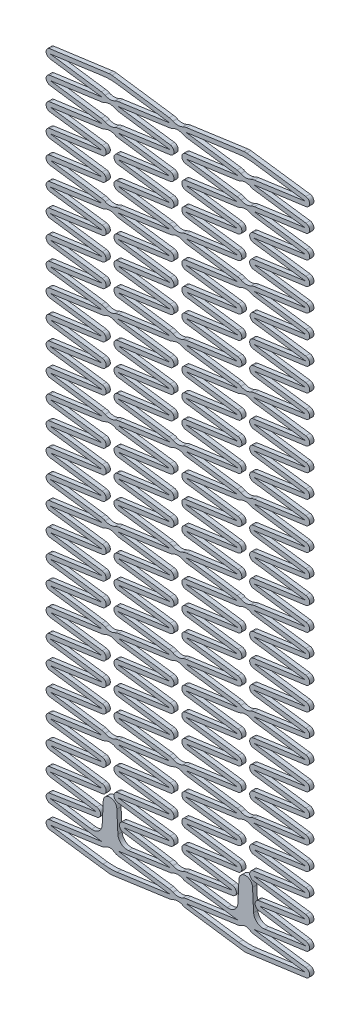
from build123d import *

# Parameters (mm, degrees)
LINEAR_AUSTRAGEN1_DEPTH = 0.2


with BuildPart() as part:
    # Skizze1 → Linear austragen1 (new body)
    with BuildSketch(Plane.XY):
        with BuildLine():
            Line((47.678280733, 2.107839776), (50.128723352, 1.769535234))
            ThreePointArc((50.128723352, 1.769535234), (50.310280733, 1.564104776), (50.128723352, 1.358674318))
            Line((50.128723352, 1.358674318), (47.678280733, 1.020369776))
            Line((47.678280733, 1.020369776), (50.128723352, 0.682065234))
            ThreePointArc((50.128723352, 0.682065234), (50.310280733, 0.476634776), (50.128723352, 0.271204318))
            Line((50.128723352, 0.271204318), (47.678280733, -0.067100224))
            Line((47.678280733, -0.067100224), (50.128723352, -0.405404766))
            ThreePointArc((50.128723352, -0.405404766), (50.310280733, -0.610835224), (50.128723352, -0.816265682))
            Line((50.128723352, -0.816265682), (47.678280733, -1.154570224))
            Line((47.678280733, -1.154570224), (50.128723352, -1.492874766))
            ThreePointArc((50.128723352, -1.492874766), (50.310280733, -1.698305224), (50.128723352, -1.903735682))
            Line((50.128723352, -1.903735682), (47.678280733, -2.242040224))
            Line((47.678280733, -2.242040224), (50.128723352, -2.580344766))
            ThreePointArc((50.128723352, -2.580344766), (50.310280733, -2.785775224), (50.128723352, -2.991205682))
            Line((50.128723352, -2.991205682), (47.678280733, -3.329510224))
            Line((47.678280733, -3.329510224), (50.128723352, -3.667814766))
            ThreePointArc((50.128723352, -3.667814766), (50.310280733, -3.873245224), (50.128723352, -4.078675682))
            Line((50.128723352, -4.078675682), (47.678280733, -4.416980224))
            Line((47.678280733, -4.416980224), (50.128723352, -4.755284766))
            ThreePointArc((50.128723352, -4.755284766), (50.310280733, -4.960715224), (50.128723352, -5.166145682))
            Line((50.128723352, -5.166145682), (47.936973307, -5.504450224))
            Line((47.936973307, -5.504450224), (50.128723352, -5.842754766))
            ThreePointArc((50.128723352, -5.842754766), (50.310280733, -6.048185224), (50.128723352, -6.253615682))
            Line((50.128723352, -6.253615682), (47.678280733, -6.591920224))
            Line((47.678280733, -6.591920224), (50.128723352, -6.930224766))
            ThreePointArc((50.128723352, -6.930224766), (50.310280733, -7.135655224), (50.128723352, -7.341085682))
            Line((50.128723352, -7.341085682), (47.337526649, -7.721250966))
            ThreePointArc((47.337526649, -7.721250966), (47.269031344, -7.725824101), (47.200555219, -7.720972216))
            Line((47.200555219, -7.720972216), (44.493838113, -7.341085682))
            ThreePointArc((44.493838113, -7.341085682), (44.403939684, -7.321957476), (44.319059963, -7.286700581))
            ThreePointArc((44.319059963, -7.286700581), (44.087280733, -7.231053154), (43.855501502, -7.286700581))
            ThreePointArc((43.855501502, -7.286700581), (43.770621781, -7.321957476), (43.680723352, -7.341085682))
            Line((43.680723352, -7.341085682), (40.974006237, -7.720972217))
            ThreePointArc((40.974006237, -7.720972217), (40.905530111, -7.725824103), (40.837034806, -7.721250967))
            Line((40.837034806, -7.721250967), (38.045838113, -7.341085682))
            ThreePointArc((38.045838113, -7.341085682), (37.864280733, -7.135655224), (38.045838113, -6.930224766))
            Line((38.045838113, -6.930224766), (40.496280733, -6.591920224))
            Line((40.496280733, -6.591920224), (38.045838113, -6.253615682))
            ThreePointArc((38.045838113, -6.253615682), (37.864280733, -6.048185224), (38.045838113, -5.842754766))
            Line((38.045838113, -5.842754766), (40.237588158, -5.504450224))
            Line((40.237588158, -5.504450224), (38.045838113, -5.166145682))
            ThreePointArc((38.045838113, -5.166145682), (37.864280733, -4.960715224), (38.045838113, -4.755284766))
            Line((38.045838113, -4.755284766), (40.496280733, -4.416980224))
            Line((40.496280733, -4.416980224), (38.045838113, -4.078675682))
            ThreePointArc((38.045838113, -4.078675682), (37.864280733, -3.873245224), (38.045838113, -3.667814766))
            Line((38.045838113, -3.667814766), (40.496280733, -3.329510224))
            Line((40.496280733, -3.329510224), (38.045838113, -2.991205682))
            ThreePointArc((38.045838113, -2.991205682), (37.864280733, -2.785775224), (38.045838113, -2.580344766))
            Line((38.045838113, -2.580344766), (40.496280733, -2.242040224))
            Line((40.496280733, -2.242040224), (38.045838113, -1.903735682))
            ThreePointArc((38.045838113, -1.903735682), (37.864280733, -1.698305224), (38.045838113, -1.492874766))
            Line((38.045838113, -1.492874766), (40.496280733, -1.154570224))
            Line((40.496280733, -1.154570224), (38.045838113, -0.816265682))
            ThreePointArc((38.045838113, -0.816265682), (37.864280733, -0.610835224), (38.045838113, -0.405404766))
            Line((38.045838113, -0.405404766), (40.496280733, -0.067100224))
            Line((40.496280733, -0.067100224), (38.045838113, 0.271204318))
            ThreePointArc((38.045838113, 0.271204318), (37.864280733, 0.476634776), (38.045838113, 0.682065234))
            Line((38.045838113, 0.682065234), (40.496280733, 1.020369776))
            Line((40.496280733, 1.020369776), (38.045838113, 1.358674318))
            ThreePointArc((38.045838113, 1.358674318), (37.864280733, 1.564104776), (38.045838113, 1.769535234))
            Line((38.045838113, 1.769535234), (40.496280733, 2.107839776))
            Line((40.496280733, 2.107839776), (38.045838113, 2.446144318))
            ThreePointArc((38.045838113, 2.446144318), (37.864280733, 2.651574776), (38.045838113, 2.857005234))
            Line((38.045838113, 2.857005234), (40.496280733, 3.195309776))
            Line((40.496280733, 3.195309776), (38.045838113, 3.533614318))
            ThreePointArc((38.045838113, 3.533614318), (37.864280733, 3.739044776), (38.045838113, 3.944475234))
            Line((38.045838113, 3.944475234), (40.496280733, 4.282779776))
            Line((40.496280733, 4.282779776), (38.045838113, 4.621084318))
            ThreePointArc((38.045838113, 4.621084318), (37.864280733, 4.826514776), (38.045838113, 5.031945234))
            Line((38.045838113, 5.031945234), (40.496280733, 5.370249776))
            Line((40.496280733, 5.370249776), (38.045838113, 5.708554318))
            ThreePointArc((38.045838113, 5.708554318), (37.864280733, 5.913984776), (38.045838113, 6.119415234))
            Line((38.045838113, 6.119415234), (40.496280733, 6.457719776))
            Line((40.496280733, 6.457719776), (38.045838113, 6.796024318))
            ThreePointArc((38.045838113, 6.796024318), (37.864280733, 7.001454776), (38.045838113, 7.206885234))
            Line((38.045838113, 7.206885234), (40.496280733, 7.545189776))
            Line((40.496280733, 7.545189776), (38.045838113, 7.883494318))
            ThreePointArc((38.045838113, 7.883494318), (37.864280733, 8.088924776), (38.045838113, 8.294355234))
            Line((38.045838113, 8.294355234), (40.496280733, 8.632659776))
            Line((40.496280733, 8.632659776), (38.045838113, 8.970964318))
            ThreePointArc((38.045838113, 8.970964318), (37.864280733, 9.176394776), (38.045838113, 9.381825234))
            Line((38.045838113, 9.381825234), (40.496280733, 9.720129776))
            Line((40.496280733, 9.720129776), (38.045838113, 10.058434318))
            ThreePointArc((38.045838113, 10.058434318), (37.864280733, 10.263864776), (38.045838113, 10.469295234))
            Line((38.045838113, 10.469295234), (40.496280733, 10.807599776))
            Line((40.496280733, 10.807599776), (38.045838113, 11.145904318))
            ThreePointArc((38.045838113, 11.145904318), (37.864280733, 11.351334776), (38.045838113, 11.556765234))
            Line((38.045838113, 11.556765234), (40.496280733, 11.895069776))
            Line((40.496280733, 11.895069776), (38.045838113, 12.233374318))
            ThreePointArc((38.045838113, 12.233374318), (37.864280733, 12.438804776), (38.045838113, 12.644235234))
            Line((38.045838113, 12.644235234), (40.496280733, 12.982539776))
            Line((40.496280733, 12.982539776), (38.045838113, 13.320844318))
            ThreePointArc((38.045838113, 13.320844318), (37.864280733, 13.526274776), (38.045838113, 13.731705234))
            Line((38.045838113, 13.731705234), (40.496280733, 14.070009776))
            Line((40.496280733, 14.070009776), (38.045838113, 14.408314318))
            ThreePointArc((38.045838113, 14.408314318), (37.864280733, 14.613744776), (38.045838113, 14.819175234))
            Line((38.045838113, 14.819175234), (40.496280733, 15.157479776))
            Line((40.496280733, 15.157479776), (38.045838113, 15.495784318))
            ThreePointArc((38.045838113, 15.495784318), (37.864280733, 15.701214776), (38.045838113, 15.906645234))
            Line((38.045838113, 15.906645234), (40.496280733, 16.244949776))
            Line((40.496280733, 16.244949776), (38.045838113, 16.583254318))
            ThreePointArc((38.045838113, 16.583254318), (37.864280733, 16.788684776), (38.045838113, 16.994115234))
            Line((38.045838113, 16.994115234), (40.496280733, 17.332419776))
            Line((40.496280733, 17.332419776), (38.045838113, 17.670724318))
            ThreePointArc((38.045838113, 17.670724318), (37.864280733, 17.876154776), (38.045838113, 18.081585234))
            Line((38.045838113, 18.081585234), (40.496280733, 18.419889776))
            Line((40.496280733, 18.419889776), (38.045838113, 18.758194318))
            ThreePointArc((38.045838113, 18.758194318), (37.864280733, 18.963624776), (38.045838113, 19.169055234))
            Line((38.045838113, 19.169055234), (40.496280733, 19.507359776))
            Line((40.496280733, 19.507359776), (38.045838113, 19.845664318))
            ThreePointArc((38.045838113, 19.845664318), (37.864280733, 20.051094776), (38.045838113, 20.256525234))
            Line((38.045838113, 20.256525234), (40.496280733, 20.594829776))
            Line((40.496280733, 20.594829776), (38.045838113, 20.933134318))
            ThreePointArc((38.045838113, 20.933134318), (37.864280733, 21.138564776), (38.045838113, 21.343995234))
            Line((38.045838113, 21.343995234), (40.496280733, 21.682299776))
            Line((40.496280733, 21.682299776), (38.045838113, 22.020604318))
            ThreePointArc((38.045838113, 22.020604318), (37.916174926, 22.088953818), (37.864280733, 22.226034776))
            ThreePointArc((37.864280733, 22.226034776), (37.916174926, 22.363115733), (38.045838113, 22.431465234))
            Line((38.045838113, 22.431465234), (40.496280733, 22.769769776))
            Line((40.496280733, 22.769769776), (38.045838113, 23.108074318))
            ThreePointArc((38.045838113, 23.108074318), (37.864280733, 23.313504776), (38.045838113, 23.518935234))
            Line((38.045838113, 23.518935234), (40.496280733, 23.857239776))
            Line((40.496280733, 23.857239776), (38.045838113, 24.195544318))
            ThreePointArc((38.045838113, 24.195544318), (37.864280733, 24.400974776), (38.045838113, 24.606405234))
            Line((38.045838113, 24.606405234), (40.837034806, 24.986570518))
            ThreePointArc((40.837034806, 24.986570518), (40.905530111, 24.991143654), (40.974006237, 24.986291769))
            Line((40.974006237, 24.986291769), (43.680723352, 24.606405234))
            ThreePointArc((43.680723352, 24.606405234), (43.770621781, 24.587277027), (43.855501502, 24.552020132))
            ThreePointArc((43.855501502, 24.552020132), (44.087280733, 24.496372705), (44.319059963, 24.552020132))
            ThreePointArc((44.319059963, 24.552020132), (44.403939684, 24.587277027), (44.493838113, 24.606405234))
            Line((44.493838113, 24.606405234), (47.200555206, 24.986291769))
            ThreePointArc((47.200555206, 24.986291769), (47.269031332, 24.991143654), (47.337526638, 24.986570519))
            Line((47.337526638, 24.986570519), (50.128723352, 24.606405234))
            ThreePointArc((50.128723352, 24.606405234), (50.310280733, 24.400974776), (50.128723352, 24.195544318))
            Line((50.128723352, 24.195544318), (47.678280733, 23.857239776))
            Line((47.678280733, 23.857239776), (50.128723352, 23.518935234))
            ThreePointArc((50.128723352, 23.518935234), (50.310280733, 23.313504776), (50.128723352, 23.108074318))
            Line((50.128723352, 23.108074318), (47.678280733, 22.769769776))
            Line((47.678280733, 22.769769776), (50.128723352, 22.431465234))
            ThreePointArc((50.128723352, 22.431465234), (50.258386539, 22.363115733), (50.310280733, 22.226034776))
            ThreePointArc((50.310280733, 22.226034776), (50.258386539, 22.088953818), (50.128723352, 22.020604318))
            Line((50.128723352, 22.020604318), (47.678280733, 21.682299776))
            Line((47.678280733, 21.682299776), (50.128723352, 21.343995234))
            ThreePointArc((50.128723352, 21.343995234), (50.310280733, 21.138564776), (50.128723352, 20.933134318))
            Line((50.128723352, 20.933134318), (47.678280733, 20.594829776))
            Line((47.678280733, 20.594829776), (50.128723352, 20.256525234))
            ThreePointArc((50.128723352, 20.256525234), (50.310280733, 20.051094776), (50.128723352, 19.845664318))
            Line((50.128723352, 19.845664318), (47.678280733, 19.507359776))
            Line((47.678280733, 19.507359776), (50.128723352, 19.169055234))
            ThreePointArc((50.128723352, 19.169055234), (50.310280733, 18.963624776), (50.128723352, 18.758194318))
            Line((50.128723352, 18.758194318), (47.678280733, 18.419889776))
            Line((47.678280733, 18.419889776), (50.128723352, 18.081585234))
            ThreePointArc((50.128723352, 18.081585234), (50.310280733, 17.876154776), (50.128723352, 17.670724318))
            Line((50.128723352, 17.670724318), (47.678280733, 17.332419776))
            Line((47.678280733, 17.332419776), (50.128723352, 16.994115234))
            ThreePointArc((50.128723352, 16.994115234), (50.310280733, 16.788684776), (50.128723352, 16.583254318))
            Line((50.128723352, 16.583254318), (47.678280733, 16.244949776))
            Line((47.678280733, 16.244949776), (50.128723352, 15.906645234))
            ThreePointArc((50.128723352, 15.906645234), (50.310280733, 15.701214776), (50.128723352, 15.495784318))
            Line((50.128723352, 15.495784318), (47.678280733, 15.157479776))
            Line((47.678280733, 15.157479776), (50.128723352, 14.819175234))
            ThreePointArc((50.128723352, 14.819175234), (50.310280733, 14.613744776), (50.128723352, 14.408314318))
            Line((50.128723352, 14.408314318), (47.678280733, 14.070009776))
            Line((47.678280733, 14.070009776), (50.128723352, 13.731705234))
            ThreePointArc((50.128723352, 13.731705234), (50.310280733, 13.526274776), (50.128723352, 13.320844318))
            Line((50.128723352, 13.320844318), (47.678280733, 12.982539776))
            Line((47.678280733, 12.982539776), (50.128723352, 12.644235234))
            ThreePointArc((50.128723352, 12.644235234), (50.310280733, 12.438804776), (50.128723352, 12.233374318))
            Line((50.128723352, 12.233374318), (47.678280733, 11.895069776))
            Line((47.678280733, 11.895069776), (50.128723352, 11.556765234))
            ThreePointArc((50.128723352, 11.556765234), (50.310280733, 11.351334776), (50.128723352, 11.145904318))
            Line((50.128723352, 11.145904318), (47.678280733, 10.807599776))
            Line((47.678280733, 10.807599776), (50.128723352, 10.469295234))
            ThreePointArc((50.128723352, 10.469295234), (50.310280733, 10.263864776), (50.128723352, 10.058434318))
            Line((50.128723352, 10.058434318), (47.678280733, 9.720129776))
            Line((47.678280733, 9.720129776), (50.128723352, 9.381825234))
            ThreePointArc((50.128723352, 9.381825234), (50.310280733, 9.176394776), (50.128723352, 8.970964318))
            Line((50.128723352, 8.970964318), (47.678280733, 8.632659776))
            Line((47.678280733, 8.632659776), (50.128723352, 8.294355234))
            ThreePointArc((50.128723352, 8.294355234), (50.310280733, 8.088924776), (50.128723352, 7.883494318))
            Line((50.128723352, 7.883494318), (47.678280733, 7.545189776))
            Line((47.678280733, 7.545189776), (50.128723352, 7.206885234))
            ThreePointArc((50.128723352, 7.206885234), (50.310280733, 7.001454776), (50.128723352, 6.796024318))
            Line((50.128723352, 6.796024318), (47.678280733, 6.457719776))
            Line((47.678280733, 6.457719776), (50.128723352, 6.119415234))
            ThreePointArc((50.128723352, 6.119415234), (50.310280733, 5.913984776), (50.128723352, 5.708554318))
            Line((50.128723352, 5.708554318), (47.678280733, 5.370249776))
            Line((47.678280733, 5.370249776), (50.128723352, 5.031945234))
            ThreePointArc((50.128723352, 5.031945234), (50.310280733, 4.826514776), (50.128723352, 4.621084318))
            Line((50.128723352, 4.621084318), (47.678280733, 4.282779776))
            Line((47.678280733, 4.282779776), (50.128723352, 3.944475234))
            ThreePointArc((50.128723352, 3.944475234), (50.310280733, 3.739044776), (50.128723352, 3.533614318))
            Line((50.128723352, 3.533614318), (47.678280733, 3.195309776))
            Line((47.678280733, 3.195309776), (50.128723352, 2.857005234))
            ThreePointArc((50.128723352, 2.857005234), (50.310280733, 2.651574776), (50.128723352, 2.446144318))
            Line((50.128723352, 2.446144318), (47.678280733, 2.107839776))
        make_face()
        with BuildLine():
            Line((43.700280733, 7.001454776), (41.289838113, 6.663150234))
            ThreePointArc((41.289838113, 6.663150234), (41.199939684, 6.644022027), (41.115059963, 6.608765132))
            ThreePointArc((41.115059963, 6.608765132), (40.883280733, 6.553117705), (40.651501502, 6.608765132))
            ThreePointArc((40.651501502, 6.608765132), (40.566621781, 6.644022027), (40.476723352, 6.663150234))
            Line((40.476723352, 6.663150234), (38.066280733, 7.001454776))
            Line((38.066280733, 7.001454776), (40.516723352, 7.339759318))
            ThreePointArc((40.516723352, 7.339759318), (40.698280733, 7.545189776), (40.516723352, 7.750620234))
            Line((40.516723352, 7.750620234), (38.066280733, 8.088924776))
            Line((38.066280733, 8.088924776), (40.516723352, 8.427229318))
            ThreePointArc((40.516723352, 8.427229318), (40.698280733, 8.632659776), (40.516723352, 8.838090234))
            Line((40.516723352, 8.838090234), (38.066280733, 9.176394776))
            Line((38.066280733, 9.176394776), (40.516723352, 9.514699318))
            ThreePointArc((40.516723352, 9.514699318), (40.698280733, 9.720129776), (40.516723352, 9.925560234))
            Line((40.516723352, 9.925560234), (38.066280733, 10.263864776))
            Line((38.066280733, 10.263864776), (40.476723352, 10.602169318))
            ThreePointArc((40.476723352, 10.602169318), (40.566621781, 10.621297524), (40.651501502, 10.656554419))
            ThreePointArc((40.651501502, 10.656554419), (40.883280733, 10.711999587), (41.115059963, 10.656554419))
            ThreePointArc((41.115059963, 10.656554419), (41.199939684, 10.621297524), (41.289838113, 10.602169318))
            Line((41.289838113, 10.602169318), (43.700280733, 10.263864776))
            Line((43.700280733, 10.263864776), (41.249838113, 9.925560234))
            ThreePointArc((41.249838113, 9.925560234), (41.068280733, 9.720129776), (41.249838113, 9.514699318))
            Line((41.249838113, 9.514699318), (43.700280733, 9.176394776))
            Line((43.700280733, 9.176394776), (41.249838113, 8.838090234))
            ThreePointArc((41.249838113, 8.838090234), (41.068280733, 8.632659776), (41.249838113, 8.427229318))
            Line((41.249838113, 8.427229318), (43.700280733, 8.088924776))
            Line((43.700280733, 8.088924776), (41.249838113, 7.750620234))
            ThreePointArc((41.249838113, 7.750620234), (41.068280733, 7.545189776), (41.249838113, 7.339759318))
            Line((41.249838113, 7.339759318), (43.700280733, 7.001454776))
        make_face(mode=Mode.SUBTRACT)
        with BuildLine():
            Line((41.289838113, 6.252289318), (43.700280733, 5.913984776))
            Line((43.700280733, 5.913984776), (41.249838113, 5.575680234))
            ThreePointArc((41.249838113, 5.575680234), (41.068280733, 5.370249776), (41.249838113, 5.164819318))
            Line((41.249838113, 5.164819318), (43.700280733, 4.826514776))
            Line((43.700280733, 4.826514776), (41.249838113, 4.488210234))
            ThreePointArc((41.249838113, 4.488210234), (41.068280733, 4.282779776), (41.249838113, 4.077349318))
            Line((41.249838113, 4.077349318), (43.700280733, 3.739044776))
            Line((43.700280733, 3.739044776), (41.249838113, 3.400740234))
            ThreePointArc((41.249838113, 3.400740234), (41.068280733, 3.195309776), (41.249838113, 2.989879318))
            Line((41.249838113, 2.989879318), (43.700280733, 2.651574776))
            Line((43.700280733, 2.651574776), (41.289838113, 2.313270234))
            ThreePointArc((41.289838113, 2.313270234), (41.199939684, 2.294142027), (41.115059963, 2.258885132))
            ThreePointArc((41.115059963, 2.258885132), (40.883280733, 2.203237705), (40.651501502, 2.258885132))
            ThreePointArc((40.651501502, 2.258885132), (40.566621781, 2.294142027), (40.476723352, 2.313270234))
            Line((40.476723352, 2.313270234), (38.066280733, 2.651574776))
            Line((38.066280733, 2.651574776), (40.516723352, 2.989879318))
            ThreePointArc((40.516723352, 2.989879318), (40.698280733, 3.195309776), (40.516723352, 3.400740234))
            Line((40.516723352, 3.400740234), (38.066280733, 3.739044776))
            Line((38.066280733, 3.739044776), (40.516723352, 4.077349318))
            ThreePointArc((40.516723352, 4.077349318), (40.698280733, 4.282779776), (40.516723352, 4.488210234))
            Line((40.516723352, 4.488210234), (38.066280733, 4.826514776))
            Line((38.066280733, 4.826514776), (40.516723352, 5.164819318))
            ThreePointArc((40.516723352, 5.164819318), (40.698280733, 5.370249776), (40.516723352, 5.575680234))
            Line((40.516723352, 5.575680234), (38.066280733, 5.913984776))
            Line((38.066280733, 5.913984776), (40.476723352, 6.252289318))
            ThreePointArc((40.476723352, 6.252289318), (40.566621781, 6.271417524), (40.651501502, 6.306674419))
            ThreePointArc((40.651501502, 6.306674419), (40.883280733, 6.362119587), (41.115059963, 6.306674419))
            ThreePointArc((41.115059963, 6.306674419), (41.199939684, 6.271417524), (41.289838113, 6.252289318))
        make_face(mode=Mode.SUBTRACT)
        with BuildLine():
            Line((47.697838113, 14.952049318), (50.108280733, 14.613744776))
            Line((50.108280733, 14.613744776), (47.657838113, 14.275440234))
            ThreePointArc((47.657838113, 14.275440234), (47.476280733, 14.070009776), (47.657838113, 13.864579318))
            Line((47.657838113, 13.864579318), (50.108280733, 13.526274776))
            Line((50.108280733, 13.526274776), (47.657838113, 13.187970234))
            ThreePointArc((47.657838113, 13.187970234), (47.476280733, 12.982539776), (47.657838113, 12.777109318))
            Line((47.657838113, 12.777109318), (50.108280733, 12.438804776))
            Line((50.108280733, 12.438804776), (47.657838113, 12.100500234))
            ThreePointArc((47.657838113, 12.100500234), (47.476280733, 11.895069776), (47.657838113, 11.689639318))
            Line((47.657838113, 11.689639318), (50.108280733, 11.351334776))
            Line((50.108280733, 11.351334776), (47.697838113, 11.013030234))
            ThreePointArc((47.697838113, 11.013030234), (47.607939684, 10.993902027), (47.523059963, 10.958645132))
            ThreePointArc((47.523059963, 10.958645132), (47.291280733, 10.902997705), (47.059501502, 10.958645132))
            ThreePointArc((47.059501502, 10.958645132), (46.974621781, 10.993902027), (46.884723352, 11.013030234))
            Line((46.884723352, 11.013030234), (44.474280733, 11.351334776))
            Line((44.474280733, 11.351334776), (46.924723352, 11.689639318))
            ThreePointArc((46.924723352, 11.689639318), (47.106280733, 11.895069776), (46.924723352, 12.100500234))
            Line((46.924723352, 12.100500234), (44.474280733, 12.438804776))
            Line((44.474280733, 12.438804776), (46.924723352, 12.777109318))
            ThreePointArc((46.924723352, 12.777109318), (47.106280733, 12.982539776), (46.924723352, 13.187970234))
            Line((46.924723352, 13.187970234), (44.474280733, 13.526274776))
            Line((44.474280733, 13.526274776), (46.924723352, 13.864579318))
            ThreePointArc((46.924723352, 13.864579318), (47.106280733, 14.070009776), (46.924723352, 14.275440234))
            Line((46.924723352, 14.275440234), (44.474280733, 14.613744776))
            Line((44.474280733, 14.613744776), (46.884723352, 14.952049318))
            ThreePointArc((46.884723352, 14.952049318), (46.974621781, 14.971177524), (47.059501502, 15.006434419))
            ThreePointArc((47.059501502, 15.006434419), (47.291280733, 15.061879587), (47.523059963, 15.006434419))
            ThreePointArc((47.523059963, 15.006434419), (47.607939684, 14.971177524), (47.697838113, 14.952049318))
        make_face(mode=Mode.SUBTRACT)
        with BuildLine():
            Line((50.108280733, 15.701214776), (47.697838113, 15.362910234))
            ThreePointArc((47.697838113, 15.362910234), (47.607939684, 15.343782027), (47.523059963, 15.308525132))
            ThreePointArc((47.523059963, 15.308525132), (47.291280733, 15.252877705), (47.059501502, 15.308525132))
            ThreePointArc((47.059501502, 15.308525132), (46.974621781, 15.343782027), (46.884723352, 15.362910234))
            Line((46.884723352, 15.362910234), (44.474280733, 15.701214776))
            Line((44.474280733, 15.701214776), (46.924723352, 16.039519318))
            ThreePointArc((46.924723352, 16.039519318), (47.106280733, 16.244949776), (46.924723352, 16.450380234))
            Line((46.924723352, 16.450380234), (44.474280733, 16.788684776))
            Line((44.474280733, 16.788684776), (46.924723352, 17.126989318))
            ThreePointArc((46.924723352, 17.126989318), (47.106280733, 17.332419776), (46.924723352, 17.537850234))
            Line((46.924723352, 17.537850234), (44.493838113, 17.876154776))
            Line((44.493838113, 17.876154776), (46.944280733, 18.214459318))
            ThreePointArc((46.944280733, 18.214459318), (47.125838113, 18.419889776), (46.944280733, 18.625320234))
            Line((46.944280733, 18.625320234), (44.493838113, 18.963624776))
            Line((44.493838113, 18.963624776), (46.904280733, 19.301929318))
            ThreePointArc((46.904280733, 19.301929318), (46.994179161, 19.321057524), (47.079058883, 19.356314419))
            ThreePointArc((47.079058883, 19.356314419), (47.310838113, 19.411961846), (47.542617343, 19.356314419))
            ThreePointArc((47.542617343, 19.356314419), (47.627497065, 19.321057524), (47.717395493, 19.301929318))
            Line((47.717395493, 19.301929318), (50.127838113, 18.963624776))
            Line((50.127838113, 18.963624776), (47.677395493, 18.625320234))
            ThreePointArc((47.677395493, 18.625320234), (47.495838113, 18.419889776), (47.677395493, 18.214459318))
            Line((47.677395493, 18.214459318), (50.127838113, 17.876154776))
            Line((50.127838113, 17.876154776), (47.657838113, 17.537850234))
            ThreePointArc((47.657838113, 17.537850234), (47.476280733, 17.332419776), (47.657838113, 17.126989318))
            Line((47.657838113, 17.126989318), (50.108280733, 16.788684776))
            Line((50.108280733, 16.788684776), (47.657838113, 16.450380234))
            ThreePointArc((47.657838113, 16.450380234), (47.476280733, 16.244949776), (47.657838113, 16.039519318))
            Line((47.657838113, 16.039519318), (50.108280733, 15.701214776))
        make_face(mode=Mode.SUBTRACT)
        with BuildLine():
            Line((47.697838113, 10.602169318), (50.108280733, 10.263864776))
            Line((50.108280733, 10.263864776), (47.657838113, 9.925560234))
            ThreePointArc((47.657838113, 9.925560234), (47.476280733, 9.720129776), (47.657838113, 9.514699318))
            Line((47.657838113, 9.514699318), (50.108280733, 9.176394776))
            Line((50.108280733, 9.176394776), (47.657838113, 8.838090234))
            ThreePointArc((47.657838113, 8.838090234), (47.476280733, 8.632659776), (47.657838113, 8.427229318))
            Line((47.657838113, 8.427229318), (50.108280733, 8.088924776))
            Line((50.108280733, 8.088924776), (47.657838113, 7.750620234))
            ThreePointArc((47.657838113, 7.750620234), (47.476280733, 7.545189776), (47.657838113, 7.339759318))
            Line((47.657838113, 7.339759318), (50.108280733, 7.001454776))
            Line((50.108280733, 7.001454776), (47.697838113, 6.663150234))
            ThreePointArc((47.697838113, 6.663150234), (47.607939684, 6.644022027), (47.523059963, 6.608765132))
            ThreePointArc((47.523059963, 6.608765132), (47.291280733, 6.553117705), (47.059501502, 6.608765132))
            ThreePointArc((47.059501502, 6.608765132), (46.974621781, 6.644022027), (46.884723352, 6.663150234))
            Line((46.884723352, 6.663150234), (44.474280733, 7.001454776))
            Line((44.474280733, 7.001454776), (46.924723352, 7.339759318))
            ThreePointArc((46.924723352, 7.339759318), (47.106280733, 7.545189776), (46.924723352, 7.750620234))
            Line((46.924723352, 7.750620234), (44.474280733, 8.088924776))
            Line((44.474280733, 8.088924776), (46.924723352, 8.427229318))
            ThreePointArc((46.924723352, 8.427229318), (47.106280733, 8.632659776), (46.924723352, 8.838090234))
            Line((46.924723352, 8.838090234), (44.474280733, 9.176394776))
            Line((44.474280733, 9.176394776), (46.924723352, 9.514699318))
            ThreePointArc((46.924723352, 9.514699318), (47.106280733, 9.720129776), (46.924723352, 9.925560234))
            Line((46.924723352, 9.925560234), (44.474280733, 10.263864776))
            Line((44.474280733, 10.263864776), (46.884723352, 10.602169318))
            ThreePointArc((46.884723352, 10.602169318), (46.974621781, 10.621297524), (47.059501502, 10.656554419))
            ThreePointArc((47.059501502, 10.656554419), (47.291280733, 10.711999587), (47.523059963, 10.656554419))
            ThreePointArc((47.523059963, 10.656554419), (47.607939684, 10.621297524), (47.697838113, 10.602169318))
        make_face(mode=Mode.SUBTRACT)
        with BuildLine():
            Line((47.697838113, 6.252289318), (50.108280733, 5.913984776))
            Line((50.108280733, 5.913984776), (47.657838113, 5.575680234))
            ThreePointArc((47.657838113, 5.575680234), (47.476280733, 5.370249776), (47.657838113, 5.164819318))
            Line((47.657838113, 5.164819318), (50.108280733, 4.826514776))
            Line((50.108280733, 4.826514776), (47.657838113, 4.488210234))
            ThreePointArc((47.657838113, 4.488210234), (47.476280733, 4.282779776), (47.657838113, 4.077349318))
            Line((47.657838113, 4.077349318), (50.108280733, 3.739044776))
            Line((50.108280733, 3.739044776), (47.657838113, 3.400740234))
            ThreePointArc((47.657838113, 3.400740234), (47.476280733, 3.195309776), (47.657838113, 2.989879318))
            Line((47.657838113, 2.989879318), (50.108280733, 2.651574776))
            Line((50.108280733, 2.651574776), (47.697838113, 2.313270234))
            ThreePointArc((47.697838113, 2.313270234), (47.607939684, 2.294142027), (47.523059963, 2.258885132))
            ThreePointArc((47.523059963, 2.258885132), (47.291280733, 2.203237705), (47.059501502, 2.258885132))
            ThreePointArc((47.059501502, 2.258885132), (46.974621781, 2.294142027), (46.884723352, 2.313270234))
            Line((46.884723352, 2.313270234), (44.474280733, 2.651574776))
            Line((44.474280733, 2.651574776), (46.924723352, 2.989879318))
            ThreePointArc((46.924723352, 2.989879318), (47.106280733, 3.195309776), (46.924723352, 3.400740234))
            Line((46.924723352, 3.400740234), (44.474280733, 3.739044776))
            Line((44.474280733, 3.739044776), (46.924723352, 4.077349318))
            ThreePointArc((46.924723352, 4.077349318), (47.106280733, 4.282779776), (46.924723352, 4.488210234))
            Line((46.924723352, 4.488210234), (44.474280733, 4.826514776))
            Line((44.474280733, 4.826514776), (46.924723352, 5.164819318))
            ThreePointArc((46.924723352, 5.164819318), (47.106280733, 5.370249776), (46.924723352, 5.575680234))
            Line((46.924723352, 5.575680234), (44.474280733, 5.913984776))
            Line((44.474280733, 5.913984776), (46.884723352, 6.252289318))
            ThreePointArc((46.884723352, 6.252289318), (46.974621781, 6.271417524), (47.059501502, 6.306674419))
            ThreePointArc((47.059501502, 6.306674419), (47.291280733, 6.362119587), (47.523059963, 6.306674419))
            ThreePointArc((47.523059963, 6.306674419), (47.607939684, 6.271417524), (47.697838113, 6.252289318))
        make_face(mode=Mode.SUBTRACT)
        with BuildLine():
            Line((47.697838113, 1.902409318), (50.108280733, 1.564104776))
            Line((50.108280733, 1.564104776), (47.657838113, 1.225800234))
            ThreePointArc((47.657838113, 1.225800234), (47.476280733, 1.020369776), (47.657838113, 0.814939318))
            Line((47.657838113, 0.814939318), (50.108280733, 0.476634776))
            Line((50.108280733, 0.476634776), (47.657838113, 0.138330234))
            ThreePointArc((47.657838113, 0.138330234), (47.476280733, -0.067100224), (47.657838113, -0.272530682))
            Line((47.657838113, -0.272530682), (50.108280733, -0.610835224))
            Line((50.108280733, -0.610835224), (47.657838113, -0.949139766))
            ThreePointArc((47.657838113, -0.949139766), (47.476280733, -1.154570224), (47.657838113, -1.360000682))
            Line((47.657838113, -1.360000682), (50.108280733, -1.698305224))
            Line((50.108280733, -1.698305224), (47.697838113, -2.036609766))
            ThreePointArc((47.697838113, -2.036609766), (47.607939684, -2.055737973), (47.523059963, -2.090994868))
            ThreePointArc((47.523059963, -2.090994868), (47.291280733, -2.146642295), (47.059501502, -2.090994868))
            ThreePointArc((47.059501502, -2.090994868), (46.974621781, -2.055737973), (46.884723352, -2.036609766))
            Line((46.884723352, -2.036609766), (44.474280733, -1.698305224))
            Line((44.474280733, -1.698305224), (46.924723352, -1.360000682))
            ThreePointArc((46.924723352, -1.360000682), (47.106280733, -1.154570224), (46.924723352, -0.949139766))
            Line((46.924723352, -0.949139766), (44.474280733, -0.610835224))
            Line((44.474280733, -0.610835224), (46.924723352, -0.272530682))
            ThreePointArc((46.924723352, -0.272530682), (47.106280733, -0.067100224), (46.924723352, 0.138330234))
            Line((46.924723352, 0.138330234), (44.474280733, 0.476634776))
            Line((44.474280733, 0.476634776), (46.924723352, 0.814939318))
            ThreePointArc((46.924723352, 0.814939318), (47.106280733, 1.020369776), (46.924723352, 1.225800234))
            Line((46.924723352, 1.225800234), (44.474280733, 1.564104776))
            Line((44.474280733, 1.564104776), (46.884723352, 1.902409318))
            ThreePointArc((46.884723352, 1.902409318), (46.974621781, 1.921537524), (47.059501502, 1.956794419))
            ThreePointArc((47.059501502, 1.956794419), (47.291280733, 2.012239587), (47.523059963, 1.956794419))
            ThreePointArc((47.523059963, 1.956794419), (47.607939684, 1.921537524), (47.697838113, 1.902409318))
        make_face(mode=Mode.SUBTRACT)
        with BuildLine():
            Line((41.270280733, 19.507359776), (43.720723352, 19.169055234))
            ThreePointArc((43.720723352, 19.169055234), (43.850386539, 19.100705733), (43.902280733, 18.963624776))
            ThreePointArc((43.902280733, 18.963624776), (43.850386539, 18.826543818), (43.720723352, 18.758194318))
            Line((43.720723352, 18.758194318), (41.270280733, 18.419889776))
            Line((41.270280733, 18.419889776), (43.720723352, 18.081585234))
            ThreePointArc((43.720723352, 18.081585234), (43.902280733, 17.876154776), (43.720723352, 17.670724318))
            Line((43.720723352, 17.670724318), (41.270280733, 17.332419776))
            Line((41.270280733, 17.332419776), (43.720723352, 16.994115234))
            ThreePointArc((43.720723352, 16.994115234), (43.902280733, 16.788684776), (43.720723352, 16.583254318))
            Line((43.720723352, 16.583254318), (41.270280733, 16.244949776))
            Line((41.270280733, 16.244949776), (43.680723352, 15.906645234))
            ThreePointArc((43.680723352, 15.906645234), (43.770621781, 15.887517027), (43.855501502, 15.852260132))
            ThreePointArc((43.855501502, 15.852260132), (44.087280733, 15.796612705), (44.319059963, 15.852260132))
            ThreePointArc((44.319059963, 15.852260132), (44.403939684, 15.887517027), (44.493838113, 15.906645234))
            Line((44.493838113, 15.906645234), (46.904280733, 16.244949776))
            Line((46.904280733, 16.244949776), (44.453838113, 16.583254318))
            ThreePointArc((44.453838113, 16.583254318), (44.272280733, 16.788684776), (44.453838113, 16.994115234))
            Line((44.453838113, 16.994115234), (46.904280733, 17.332419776))
            Line((46.904280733, 17.332419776), (44.453838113, 17.670724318))
            ThreePointArc((44.453838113, 17.670724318), (44.272280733, 17.876154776), (44.453838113, 18.081585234))
            Line((44.453838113, 18.081585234), (46.904280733, 18.419889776))
            Line((46.904280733, 18.419889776), (44.453838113, 18.758194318))
            ThreePointArc((44.453838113, 18.758194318), (44.324174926, 18.826543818), (44.272280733, 18.963624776))
            ThreePointArc((44.272280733, 18.963624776), (44.324174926, 19.100705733), (44.453838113, 19.169055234))
            Line((44.453838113, 19.169055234), (46.904280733, 19.507359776))
            Line((46.904280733, 19.507359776), (44.493838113, 19.845664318))
            ThreePointArc((44.493838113, 19.845664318), (44.403939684, 19.864792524), (44.319059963, 19.900049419))
            ThreePointArc((44.319059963, 19.900049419), (44.087280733, 19.955696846), (43.855501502, 19.900049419))
            ThreePointArc((43.855501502, 19.900049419), (43.770621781, 19.864792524), (43.680723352, 19.845664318))
            Line((43.680723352, 19.845664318), (41.270280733, 19.507359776))
        make_face(mode=Mode.SUBTRACT)
        with BuildLine():
            Line((41.270280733, 15.157479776), (43.720723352, 14.819175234))
            ThreePointArc((43.720723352, 14.819175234), (43.902280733, 14.613744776), (43.720723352, 14.408314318))
            Line((43.720723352, 14.408314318), (41.270280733, 14.070009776))
            Line((41.270280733, 14.070009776), (43.720723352, 13.731705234))
            ThreePointArc((43.720723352, 13.731705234), (43.902280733, 13.526274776), (43.720723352, 13.320844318))
            Line((43.720723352, 13.320844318), (41.270280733, 12.982539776))
            Line((41.270280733, 12.982539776), (43.720723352, 12.644235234))
            ThreePointArc((43.720723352, 12.644235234), (43.902280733, 12.438804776), (43.720723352, 12.233374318))
            Line((43.720723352, 12.233374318), (41.270280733, 11.895069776))
            Line((41.270280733, 11.895069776), (43.680723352, 11.556765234))
            ThreePointArc((43.680723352, 11.556765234), (43.770621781, 11.537637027), (43.855501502, 11.502380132))
            ThreePointArc((43.855501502, 11.502380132), (44.087280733, 11.446732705), (44.319059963, 11.502380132))
            ThreePointArc((44.319059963, 11.502380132), (44.403939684, 11.537637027), (44.493838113, 11.556765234))
            Line((44.493838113, 11.556765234), (46.904280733, 11.895069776))
            Line((46.904280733, 11.895069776), (44.453838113, 12.233374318))
            ThreePointArc((44.453838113, 12.233374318), (44.272280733, 12.438804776), (44.453838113, 12.644235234))
            Line((44.453838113, 12.644235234), (46.904280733, 12.982539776))
            Line((46.904280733, 12.982539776), (44.453838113, 13.320844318))
            ThreePointArc((44.453838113, 13.320844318), (44.272280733, 13.526274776), (44.453838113, 13.731705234))
            Line((44.453838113, 13.731705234), (46.904280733, 14.070009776))
            Line((46.904280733, 14.070009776), (44.453838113, 14.408314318))
            ThreePointArc((44.453838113, 14.408314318), (44.272280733, 14.613744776), (44.453838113, 14.819175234))
            Line((44.453838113, 14.819175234), (46.904280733, 15.157479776))
            Line((46.904280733, 15.157479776), (44.493838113, 15.495784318))
            ThreePointArc((44.493838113, 15.495784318), (44.403939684, 15.514912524), (44.319059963, 15.550169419))
            ThreePointArc((44.319059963, 15.550169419), (44.087280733, 15.605614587), (43.855501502, 15.550169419))
            ThreePointArc((43.855501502, 15.550169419), (43.770621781, 15.514912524), (43.680723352, 15.495784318))
            Line((43.680723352, 15.495784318), (41.270280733, 15.157479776))
        make_face(mode=Mode.SUBTRACT)
        with BuildLine():
            Line((44.453838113, 10.058434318), (46.904280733, 9.720129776))
            Line((46.904280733, 9.720129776), (44.453838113, 9.381825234))
            ThreePointArc((44.453838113, 9.381825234), (44.272280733, 9.176394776), (44.453838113, 8.970964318))
            Line((44.453838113, 8.970964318), (46.904280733, 8.632659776))
            Line((46.904280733, 8.632659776), (44.453838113, 8.294355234))
            ThreePointArc((44.453838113, 8.294355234), (44.272280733, 8.088924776), (44.453838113, 7.883494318))
            Line((44.453838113, 7.883494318), (46.904280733, 7.545189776))
            Line((46.904280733, 7.545189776), (44.493838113, 7.206885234))
            ThreePointArc((44.493838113, 7.206885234), (44.403939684, 7.187757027), (44.319059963, 7.152500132))
            ThreePointArc((44.319059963, 7.152500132), (44.087280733, 7.096852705), (43.855501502, 7.152500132))
            ThreePointArc((43.855501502, 7.152500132), (43.770621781, 7.187757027), (43.680723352, 7.206885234))
            Line((43.680723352, 7.206885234), (41.270280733, 7.545189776))
            Line((41.270280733, 7.545189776), (43.720723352, 7.883494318))
            ThreePointArc((43.720723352, 7.883494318), (43.902280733, 8.088924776), (43.720723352, 8.294355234))
            Line((43.720723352, 8.294355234), (41.270280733, 8.632659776))
            Line((41.270280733, 8.632659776), (43.720723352, 8.970964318))
            ThreePointArc((43.720723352, 8.970964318), (43.902280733, 9.176394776), (43.720723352, 9.381825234))
            Line((43.720723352, 9.381825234), (41.270280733, 9.720129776))
            Line((41.270280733, 9.720129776), (43.720723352, 10.058434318))
            ThreePointArc((43.720723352, 10.058434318), (43.902280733, 10.263864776), (43.720723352, 10.469295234))
            Line((43.720723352, 10.469295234), (41.270280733, 10.807599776))
            Line((41.270280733, 10.807599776), (43.680723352, 11.145904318))
            ThreePointArc((43.680723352, 11.145904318), (43.770621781, 11.165032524), (43.855501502, 11.200289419))
            ThreePointArc((43.855501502, 11.200289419), (44.087280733, 11.255734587), (44.319059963, 11.200289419))
            ThreePointArc((44.319059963, 11.200289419), (44.403939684, 11.165032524), (44.493838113, 11.145904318))
            Line((44.493838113, 11.145904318), (46.904280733, 10.807599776))
            Line((46.904280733, 10.807599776), (44.453838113, 10.469295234))
            ThreePointArc((44.453838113, 10.469295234), (44.272280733, 10.263864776), (44.453838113, 10.058434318))
        make_face(mode=Mode.SUBTRACT)
        with BuildLine():
            Line((44.453838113, 3.533614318), (46.904280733, 3.195309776))
            Line((46.904280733, 3.195309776), (44.493838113, 2.857005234))
            ThreePointArc((44.493838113, 2.857005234), (44.403939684, 2.837877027), (44.319059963, 2.802620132))
            ThreePointArc((44.319059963, 2.802620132), (44.087280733, 2.746972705), (43.855501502, 2.802620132))
            ThreePointArc((43.855501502, 2.802620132), (43.770621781, 2.837877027), (43.680723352, 2.857005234))
            Line((43.680723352, 2.857005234), (41.270280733, 3.195309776))
            Line((41.270280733, 3.195309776), (43.720723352, 3.533614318))
            ThreePointArc((43.720723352, 3.533614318), (43.902280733, 3.739044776), (43.720723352, 3.944475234))
            Line((43.720723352, 3.944475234), (41.270280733, 4.282779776))
            Line((41.270280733, 4.282779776), (43.720723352, 4.621084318))
            ThreePointArc((43.720723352, 4.621084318), (43.902280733, 4.826514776), (43.720723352, 5.031945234))
            Line((43.720723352, 5.031945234), (41.270280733, 5.370249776))
            Line((41.270280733, 5.370249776), (43.720723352, 5.708554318))
            ThreePointArc((43.720723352, 5.708554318), (43.902280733, 5.913984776), (43.720723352, 6.119415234))
            Line((43.720723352, 6.119415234), (41.270280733, 6.457719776))
            Line((41.270280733, 6.457719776), (43.680723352, 6.796024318))
            ThreePointArc((43.680723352, 6.796024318), (43.770621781, 6.815152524), (43.855501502, 6.850409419))
            ThreePointArc((43.855501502, 6.850409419), (44.087280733, 6.905854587), (44.319059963, 6.850409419))
            ThreePointArc((44.319059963, 6.850409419), (44.403939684, 6.815152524), (44.493838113, 6.796024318))
            Line((44.493838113, 6.796024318), (46.904280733, 6.457719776))
            Line((46.904280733, 6.457719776), (44.453838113, 6.119415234))
            ThreePointArc((44.453838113, 6.119415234), (44.272280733, 5.913984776), (44.453838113, 5.708554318))
            Line((44.453838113, 5.708554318), (46.904280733, 5.370249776))
            Line((46.904280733, 5.370249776), (44.453838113, 5.031945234))
            ThreePointArc((44.453838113, 5.031945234), (44.272280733, 4.826514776), (44.453838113, 4.621084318))
            Line((44.453838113, 4.621084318), (46.904280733, 4.282779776))
            Line((46.904280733, 4.282779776), (44.453838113, 3.944475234))
            ThreePointArc((44.453838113, 3.944475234), (44.272280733, 3.739044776), (44.453838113, 3.533614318))
        make_face(mode=Mode.SUBTRACT)
        with BuildLine():
            Line((41.249838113, 12.777109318), (43.700280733, 12.438804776))
            Line((43.700280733, 12.438804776), (41.249838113, 12.100500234))
            ThreePointArc((41.249838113, 12.100500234), (41.068280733, 11.895069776), (41.249838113, 11.689639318))
            Line((41.249838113, 11.689639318), (43.700280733, 11.351334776))
            Line((43.700280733, 11.351334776), (41.289838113, 11.013030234))
            ThreePointArc((41.289838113, 11.013030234), (41.199939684, 10.993902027), (41.115059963, 10.958645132))
            ThreePointArc((41.115059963, 10.958645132), (40.883280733, 10.902997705), (40.651501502, 10.958645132))
            ThreePointArc((40.651501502, 10.958645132), (40.566621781, 10.993902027), (40.476723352, 11.013030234))
            Line((40.476723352, 11.013030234), (38.066280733, 11.351334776))
            Line((38.066280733, 11.351334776), (40.516723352, 11.689639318))
            ThreePointArc((40.516723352, 11.689639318), (40.698280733, 11.895069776), (40.516723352, 12.100500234))
            Line((40.516723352, 12.100500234), (38.066280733, 12.438804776))
            Line((38.066280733, 12.438804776), (40.516723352, 12.777109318))
            ThreePointArc((40.516723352, 12.777109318), (40.698280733, 12.982539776), (40.516723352, 13.187970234))
            Line((40.516723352, 13.187970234), (38.066280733, 13.526274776))
            Line((38.066280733, 13.526274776), (40.516723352, 13.864579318))
            ThreePointArc((40.516723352, 13.864579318), (40.698280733, 14.070009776), (40.516723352, 14.275440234))
            Line((40.516723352, 14.275440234), (38.066280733, 14.613744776))
            Line((38.066280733, 14.613744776), (40.476723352, 14.952049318))
            ThreePointArc((40.476723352, 14.952049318), (40.566621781, 14.971177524), (40.651501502, 15.006434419))
            ThreePointArc((40.651501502, 15.006434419), (40.883280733, 15.061879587), (41.115059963, 15.006434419))
            ThreePointArc((41.115059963, 15.006434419), (41.199939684, 14.971177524), (41.289838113, 14.952049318))
            Line((41.289838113, 14.952049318), (43.700280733, 14.613744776))
            Line((43.700280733, 14.613744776), (41.249838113, 14.275440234))
            ThreePointArc((41.249838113, 14.275440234), (41.068280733, 14.070009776), (41.249838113, 13.864579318))
            Line((41.249838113, 13.864579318), (43.700280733, 13.526274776))
            Line((43.700280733, 13.526274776), (41.249838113, 13.187970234))
            ThreePointArc((41.249838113, 13.187970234), (41.068280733, 12.982539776), (41.249838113, 12.777109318))
        make_face(mode=Mode.SUBTRACT)
        with BuildLine():
            Line((41.270280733, 1.020369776), (43.720723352, 0.682065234))
            ThreePointArc((43.720723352, 0.682065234), (43.902280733, 0.476634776), (43.720723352, 0.271204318))
            Line((43.720723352, 0.271204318), (41.270280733, -0.067100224))
            Line((41.270280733, -0.067100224), (43.720723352, -0.405404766))
            ThreePointArc((43.720723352, -0.405404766), (43.902280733, -0.610835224), (43.720723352, -0.816265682))
            Line((43.720723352, -0.816265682), (41.270280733, -1.154570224))
            Line((41.270280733, -1.154570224), (43.680723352, -1.492874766))
            ThreePointArc((43.680723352, -1.492874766), (43.770621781, -1.512002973), (43.855501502, -1.547259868))
            ThreePointArc((43.855501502, -1.547259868), (44.087280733, -1.602907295), (44.319059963, -1.547259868))
            ThreePointArc((44.319059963, -1.547259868), (44.403939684, -1.512002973), (44.493838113, -1.492874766))
            Line((44.493838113, -1.492874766), (46.904280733, -1.154570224))
            Line((46.904280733, -1.154570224), (44.453838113, -0.816265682))
            ThreePointArc((44.453838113, -0.816265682), (44.272280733, -0.610835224), (44.453838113, -0.405404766))
            Line((44.453838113, -0.405404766), (46.904280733, -0.067100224))
            Line((46.904280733, -0.067100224), (44.453838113, 0.271204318))
            ThreePointArc((44.453838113, 0.271204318), (44.272280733, 0.476634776), (44.453838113, 0.682065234))
            Line((44.453838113, 0.682065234), (46.904280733, 1.020369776))
            Line((46.904280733, 1.020369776), (44.453838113, 1.358674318))
            ThreePointArc((44.453838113, 1.358674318), (44.272280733, 1.564104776), (44.453838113, 1.769535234))
            Line((44.453838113, 1.769535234), (46.904280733, 2.107839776))
            Line((46.904280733, 2.107839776), (44.493838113, 2.446144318))
            ThreePointArc((44.493838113, 2.446144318), (44.403939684, 2.465272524), (44.319059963, 2.500529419))
            ThreePointArc((44.319059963, 2.500529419), (44.087280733, 2.555974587), (43.855501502, 2.500529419))
            ThreePointArc((43.855501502, 2.500529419), (43.770621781, 2.465272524), (43.680723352, 2.446144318))
            Line((43.680723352, 2.446144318), (41.270280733, 2.107839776))
            Line((41.270280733, 2.107839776), (43.720723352, 1.769535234))
            ThreePointArc((43.720723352, 1.769535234), (43.902280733, 1.564104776), (43.720723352, 1.358674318))
            Line((43.720723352, 1.358674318), (41.270280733, 1.020369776))
        make_face(mode=Mode.SUBTRACT)
        with BuildLine():
            Line((43.700280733, 0.476634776), (41.249838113, 0.138330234))
            ThreePointArc((41.249838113, 0.138330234), (41.068280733, -0.067100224), (41.249838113, -0.272530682))
            Line((41.249838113, -0.272530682), (43.700280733, -0.610835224))
            Line((43.700280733, -0.610835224), (41.249838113, -0.949139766))
            ThreePointArc((41.249838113, -0.949139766), (41.068280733, -1.154570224), (41.249838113, -1.360000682))
            Line((41.249838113, -1.360000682), (43.700280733, -1.698305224))
            Line((43.700280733, -1.698305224), (41.289838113, -2.036609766))
            ThreePointArc((41.289838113, -2.036609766), (41.199939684, -2.055737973), (41.115059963, -2.090994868))
            ThreePointArc((41.115059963, -2.090994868), (40.883280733, -2.146642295), (40.651501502, -2.090994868))
            ThreePointArc((40.651501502, -2.090994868), (40.566621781, -2.055737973), (40.476723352, -2.036609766))
            Line((40.476723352, -2.036609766), (38.066280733, -1.698305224))
            Line((38.066280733, -1.698305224), (40.516723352, -1.360000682))
            ThreePointArc((40.516723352, -1.360000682), (40.698280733, -1.154570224), (40.516723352, -0.949139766))
            Line((40.516723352, -0.949139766), (38.066280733, -0.610835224))
            Line((38.066280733, -0.610835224), (40.516723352, -0.272530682))
            ThreePointArc((40.516723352, -0.272530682), (40.698280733, -0.067100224), (40.516723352, 0.138330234))
            Line((40.516723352, 0.138330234), (38.066280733, 0.476634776))
            Line((38.066280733, 0.476634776), (40.516723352, 0.814939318))
            ThreePointArc((40.516723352, 0.814939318), (40.698280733, 1.020369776), (40.516723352, 1.225800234))
            Line((40.516723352, 1.225800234), (38.066280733, 1.564104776))
            Line((38.066280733, 1.564104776), (40.476723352, 1.902409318))
            ThreePointArc((40.476723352, 1.902409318), (40.566621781, 1.921537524), (40.651501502, 1.956794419))
            ThreePointArc((40.651501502, 1.956794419), (40.883280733, 2.012239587), (41.115059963, 1.956794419))
            ThreePointArc((41.115059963, 1.956794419), (41.199939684, 1.921537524), (41.289838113, 1.902409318))
            Line((41.289838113, 1.902409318), (43.700280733, 1.564104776))
            Line((43.700280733, 1.564104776), (41.249838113, 1.225800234))
            ThreePointArc((41.249838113, 1.225800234), (41.068280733, 1.020369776), (41.249838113, 0.814939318))
            Line((41.249838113, 0.814939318), (43.700280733, 0.476634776))
        make_face(mode=Mode.SUBTRACT)
        with BuildLine():
            Line((44.493838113, -6.253615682), (46.904280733, -6.591920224))
            Line((46.904280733, -6.591920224), (44.493838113, -6.930224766))
            ThreePointArc((44.493838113, -6.930224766), (44.403939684, -6.949352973), (44.319059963, -6.984609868))
            ThreePointArc((44.319059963, -6.984609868), (44.087280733, -7.040257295), (43.855501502, -6.984609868))
            ThreePointArc((43.855501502, -6.984609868), (43.770621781, -6.949352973), (43.680723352, -6.930224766))
            Line((43.680723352, -6.930224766), (41.270280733, -6.591920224))
            Line((41.270280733, -6.591920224), (43.680723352, -6.253615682))
            ThreePointArc((43.680723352, -6.253615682), (43.770621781, -6.234487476), (43.855501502, -6.199230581))
            ThreePointArc((43.855501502, -6.199230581), (44.087280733, -6.143583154), (44.319059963, -6.199230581))
            ThreePointArc((44.319059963, -6.199230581), (44.403939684, -6.234487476), (44.493838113, -6.253615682))
        make_face(mode=Mode.SUBTRACT)
        with BuildLine():
            Line((41.528973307, -5.504450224), (43.680723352, -5.842754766))
            ThreePointArc((43.680723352, -5.842754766), (43.770621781, -5.861882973), (43.855501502, -5.897139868))
            ThreePointArc((43.855501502, -5.897139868), (44.087280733, -5.952787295), (44.319059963, -5.897139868))
            ThreePointArc((44.319059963, -5.897139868), (44.403939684, -5.861882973), (44.493838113, -5.842754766))
            Line((44.493838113, -5.842754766), (46.645588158, -5.504450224))
            Line((46.645588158, -5.504450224), (44.453838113, -5.166145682))
            ThreePointArc((44.453838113, -5.166145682), (44.272280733, -4.960715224), (44.453838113, -4.755284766))
            Line((44.453838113, -4.755284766), (46.904280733, -4.416980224))
            Line((46.904280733, -4.416980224), (44.453838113, -4.078675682))
            ThreePointArc((44.453838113, -4.078675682), (44.272280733, -3.873245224), (44.453838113, -3.667814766))
            Line((44.453838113, -3.667814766), (46.904280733, -3.329510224))
            Line((46.904280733, -3.329510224), (44.453838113, -2.991205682))
            ThreePointArc((44.453838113, -2.991205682), (44.272280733, -2.785775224), (44.453838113, -2.580344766))
            Line((44.453838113, -2.580344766), (46.904280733, -2.242040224))
            Line((46.904280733, -2.242040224), (44.493838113, -1.903735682))
            ThreePointArc((44.493838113, -1.903735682), (44.403939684, -1.884607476), (44.319059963, -1.849350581))
            ThreePointArc((44.319059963, -1.849350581), (44.087280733, -1.793905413), (43.855501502, -1.849350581))
            ThreePointArc((43.855501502, -1.849350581), (43.770621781, -1.884607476), (43.680723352, -1.903735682))
            Line((43.680723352, -1.903735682), (41.270280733, -2.242040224))
            Line((41.270280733, -2.242040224), (43.720723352, -2.580344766))
            ThreePointArc((43.720723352, -2.580344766), (43.902280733, -2.785775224), (43.720723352, -2.991205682))
            Line((43.720723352, -2.991205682), (41.270280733, -3.329510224))
            Line((41.270280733, -3.329510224), (43.720723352, -3.667814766))
            ThreePointArc((43.720723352, -3.667814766), (43.902280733, -3.873245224), (43.720723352, -4.078675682))
            Line((43.720723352, -4.078675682), (41.270280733, -4.416980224))
            Line((41.270280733, -4.416980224), (43.720723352, -4.755284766))
            ThreePointArc((43.720723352, -4.755284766), (43.902280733, -4.960715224), (43.720723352, -5.166145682))
            Line((43.720723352, -5.166145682), (41.528973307, -5.504450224))
        make_face(mode=Mode.SUBTRACT)
        with BuildLine():
            Line((40.258030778, -5.709880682), (38.066280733, -6.048185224))
            Line((38.066280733, -6.048185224), (40.008567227, -6.328508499))
            ThreePointArc((40.008567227, -6.328508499), (40.348841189, -6.230195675), (40.512575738, -5.916121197))
            Line((40.512575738, -5.916121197), (40.561980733, -4.907947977))
            ThreePointArc((40.561980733, -4.907947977), (40.883280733, -4.586647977), (41.204580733, -4.907947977))
            Line((41.204580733, -4.907947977), (41.253985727, -5.916121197))
            ThreePointArc((41.253985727, -5.916121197), (41.417720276, -6.230195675), (41.757994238, -6.328508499))
            Line((41.757994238, -6.328508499), (43.700280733, -6.048185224))
            Line((43.700280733, -6.048185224), (41.508530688, -5.709880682))
            ThreePointArc((41.508530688, -5.709880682), (41.326973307, -5.504450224), (41.508530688, -5.299019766))
            Line((41.508530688, -5.299019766), (43.700280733, -4.960715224))
            Line((43.700280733, -4.960715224), (41.249838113, -4.622410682))
            ThreePointArc((41.249838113, -4.622410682), (41.068280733, -4.416980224), (41.249838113, -4.211549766))
            Line((41.249838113, -4.211549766), (43.700280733, -3.873245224))
            Line((43.700280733, -3.873245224), (41.249838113, -3.534940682))
            ThreePointArc((41.249838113, -3.534940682), (41.068280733, -3.329510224), (41.249838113, -3.124079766))
            Line((41.249838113, -3.124079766), (43.700280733, -2.785775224))
            Line((43.700280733, -2.785775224), (41.289838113, -2.447470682))
            ThreePointArc((41.289838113, -2.447470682), (41.199939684, -2.428342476), (41.115059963, -2.393085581))
            ThreePointArc((41.115059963, -2.393085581), (40.883280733, -2.337640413), (40.651501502, -2.393085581))
            ThreePointArc((40.651501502, -2.393085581), (40.566621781, -2.428342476), (40.476723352, -2.447470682))
            Line((40.476723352, -2.447470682), (38.066280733, -2.785775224))
            Line((38.066280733, -2.785775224), (40.516723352, -3.124079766))
            ThreePointArc((40.516723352, -3.124079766), (40.698280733, -3.329510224), (40.516723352, -3.534940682))
            Line((40.516723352, -3.534940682), (38.066280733, -3.873245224))
            Line((38.066280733, -3.873245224), (40.516723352, -4.211549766))
            ThreePointArc((40.516723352, -4.211549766), (40.698280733, -4.416980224), (40.516723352, -4.622410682))
            Line((40.516723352, -4.622410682), (38.066280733, -4.960715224))
            Line((38.066280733, -4.960715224), (40.258030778, -5.299019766))
            ThreePointArc((40.258030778, -5.299019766), (40.439588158, -5.504450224), (40.258030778, -5.709880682))
        make_face(mode=Mode.SUBTRACT)
        with BuildLine():
            Line((46.666030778, -5.709880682), (44.474280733, -6.048185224))
            Line((44.474280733, -6.048185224), (46.416567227, -6.328508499))
            ThreePointArc((46.416567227, -6.328508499), (46.756841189, -6.230195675), (46.920575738, -5.916121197))
            Line((46.920575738, -5.916121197), (46.969980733, -4.907947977))
            ThreePointArc((46.969980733, -4.907947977), (47.291280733, -4.586647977), (47.612580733, -4.907947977))
            Line((47.612580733, -4.907947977), (47.661985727, -5.916121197))
            ThreePointArc((47.661985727, -5.916121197), (47.825720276, -6.230195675), (48.165994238, -6.328508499))
            Line((48.165994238, -6.328508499), (50.108280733, -6.048185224))
            Line((50.108280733, -6.048185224), (47.916530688, -5.709880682))
            ThreePointArc((47.916530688, -5.709880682), (47.734973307, -5.504450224), (47.916530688, -5.299019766))
            Line((47.916530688, -5.299019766), (50.108280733, -4.960715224))
            Line((50.108280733, -4.960715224), (47.657838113, -4.622410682))
            ThreePointArc((47.657838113, -4.622410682), (47.476280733, -4.416980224), (47.657838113, -4.211549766))
            Line((47.657838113, -4.211549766), (50.108280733, -3.873245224))
            Line((50.108280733, -3.873245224), (47.657838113, -3.534940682))
            ThreePointArc((47.657838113, -3.534940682), (47.476280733, -3.329510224), (47.657838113, -3.124079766))
            Line((47.657838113, -3.124079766), (50.108280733, -2.785775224))
            Line((50.108280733, -2.785775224), (47.697838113, -2.447470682))
            ThreePointArc((47.697838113, -2.447470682), (47.607939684, -2.428342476), (47.523059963, -2.393085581))
            ThreePointArc((47.523059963, -2.393085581), (47.291280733, -2.337640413), (47.059501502, -2.393085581))
            ThreePointArc((47.059501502, -2.393085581), (46.974621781, -2.428342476), (46.884723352, -2.447470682))
            Line((46.884723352, -2.447470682), (44.474280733, -2.785775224))
            Line((44.474280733, -2.785775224), (46.924723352, -3.124079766))
            ThreePointArc((46.924723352, -3.124079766), (47.106280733, -3.329510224), (46.924723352, -3.534940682))
            Line((46.924723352, -3.534940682), (44.474280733, -3.873245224))
            Line((44.474280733, -3.873245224), (46.924723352, -4.211549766))
            ThreePointArc((46.924723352, -4.211549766), (47.106280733, -4.416980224), (46.924723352, -4.622410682))
            Line((46.924723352, -4.622410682), (44.474280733, -4.960715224))
            Line((44.474280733, -4.960715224), (46.666030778, -5.299019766))
            ThreePointArc((46.666030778, -5.299019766), (46.847588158, -5.504450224), (46.666030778, -5.709880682))
        make_face(mode=Mode.SUBTRACT)
        with BuildLine():
            Line((38.066280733, -7.135655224), (40.476723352, -6.797350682))
            ThreePointArc((40.476723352, -6.797350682), (40.590091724, -6.770276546), (40.694114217, -6.717695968))
            ThreePointArc((40.694114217, -6.717695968), (40.883280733, -6.656323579), (41.072447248, -6.717695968))
            ThreePointArc((41.072447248, -6.717695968), (41.176469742, -6.770276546), (41.289838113, -6.797350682))
            Line((41.289838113, -6.797350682), (43.700280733, -7.135655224))
            Line((43.700280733, -7.135655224), (41.215140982, -7.483211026))
            ThreePointArc((41.215140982, -7.483211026), (40.883280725, -7.503683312), (40.551420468, -7.483211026))
            Line((40.551420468, -7.483211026), (38.066280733, -7.135655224))
        make_face(mode=Mode.SUBTRACT)
        with BuildLine():
            Line((50.108280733, -7.135655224), (47.697838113, -6.797350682))
            ThreePointArc((47.697838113, -6.797350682), (47.584469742, -6.770276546), (47.480447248, -6.717695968))
            ThreePointArc((47.480447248, -6.717695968), (47.291280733, -6.656323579), (47.102114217, -6.717695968))
            ThreePointArc((47.102114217, -6.717695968), (46.998091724, -6.770276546), (46.884723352, -6.797350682))
            Line((46.884723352, -6.797350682), (44.474280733, -7.135655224))
            Line((44.474280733, -7.135655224), (46.959420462, -7.483211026))
            ThreePointArc((46.959420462, -7.483211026), (47.291280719, -7.503683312), (47.623140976, -7.483211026))
            Line((47.623140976, -7.483211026), (50.108280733, -7.135655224))
        make_face(mode=Mode.SUBTRACT)
        with BuildLine():
            Line((38.066280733, 24.400974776), (40.476723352, 24.062670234))
            ThreePointArc((40.476723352, 24.062670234), (40.566621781, 24.043542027), (40.651501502, 24.008285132))
            ThreePointArc((40.651501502, 24.008285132), (40.883280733, 23.952637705), (41.115059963, 24.008285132))
            ThreePointArc((41.115059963, 24.008285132), (41.199939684, 24.043542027), (41.289838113, 24.062670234))
            Line((41.289838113, 24.062670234), (43.700280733, 24.400974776))
            Line((43.700280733, 24.400974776), (41.215140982, 24.748530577))
            ThreePointArc((41.215140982, 24.748530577), (40.883280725, 24.769002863), (40.551420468, 24.748530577))
            Line((40.551420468, 24.748530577), (38.066280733, 24.400974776))
        make_face(mode=Mode.SUBTRACT)
        with BuildLine():
            Line((47.657838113, 21.476869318), (50.108280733, 21.138564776))
            Line((50.108280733, 21.138564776), (47.657838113, 20.800260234))
            ThreePointArc((47.657838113, 20.800260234), (47.476280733, 20.594829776), (47.657838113, 20.389399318))
            Line((47.657838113, 20.389399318), (50.127838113, 20.051094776))
            Line((50.127838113, 20.051094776), (47.717395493, 19.712790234))
            ThreePointArc((47.717395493, 19.712790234), (47.627497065, 19.693662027), (47.542617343, 19.658405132))
            ThreePointArc((47.542617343, 19.658405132), (47.310838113, 19.602757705), (47.079058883, 19.658405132))
            ThreePointArc((47.079058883, 19.658405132), (46.994179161, 19.693662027), (46.904280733, 19.712790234))
            Line((46.904280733, 19.712790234), (44.474280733, 20.051094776))
            Line((44.474280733, 20.051094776), (46.924723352, 20.389399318))
            ThreePointArc((46.924723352, 20.389399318), (47.106280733, 20.594829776), (46.924723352, 20.800260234))
            Line((46.924723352, 20.800260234), (44.474280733, 21.138564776))
            Line((44.474280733, 21.138564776), (46.924723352, 21.476869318))
            ThreePointArc((46.924723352, 21.476869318), (47.106280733, 21.682299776), (46.924723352, 21.887730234))
            Line((46.924723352, 21.887730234), (44.474280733, 22.226034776))
            Line((44.474280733, 22.226034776), (46.884723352, 22.564339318))
            ThreePointArc((46.884723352, 22.564339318), (46.974621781, 22.583467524), (47.059501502, 22.618724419))
            ThreePointArc((47.059501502, 22.618724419), (47.291280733, 22.674371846), (47.523059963, 22.618724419))
            ThreePointArc((47.523059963, 22.618724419), (47.607939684, 22.583467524), (47.697838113, 22.564339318))
            Line((47.697838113, 22.564339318), (50.108280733, 22.226034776))
            Line((50.108280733, 22.226034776), (47.657838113, 21.887730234))
            ThreePointArc((47.657838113, 21.887730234), (47.476280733, 21.682299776), (47.657838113, 21.476869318))
        make_face(mode=Mode.SUBTRACT)
        with BuildLine():
            Line((44.453838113, 22.431465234), (46.904280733, 22.769769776))
            Line((46.904280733, 22.769769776), (44.453838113, 23.108074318))
            ThreePointArc((44.453838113, 23.108074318), (44.272280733, 23.313504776), (44.453838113, 23.518935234))
            Line((44.453838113, 23.518935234), (46.904280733, 23.857239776))
            Line((46.904280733, 23.857239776), (44.493838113, 24.195544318))
            ThreePointArc((44.493838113, 24.195544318), (44.403939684, 24.214672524), (44.319059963, 24.249929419))
            ThreePointArc((44.319059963, 24.249929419), (44.087280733, 24.305576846), (43.855501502, 24.249929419))
            ThreePointArc((43.855501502, 24.249929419), (43.770621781, 24.214672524), (43.680723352, 24.195544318))
            Line((43.680723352, 24.195544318), (41.270280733, 23.857239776))
            Line((41.270280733, 23.857239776), (43.720723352, 23.518935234))
            ThreePointArc((43.720723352, 23.518935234), (43.902280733, 23.313504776), (43.720723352, 23.108074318))
            Line((43.720723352, 23.108074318), (41.270280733, 22.769769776))
            Line((41.270280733, 22.769769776), (43.720723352, 22.431465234))
            ThreePointArc((43.720723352, 22.431465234), (43.850386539, 22.363115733), (43.902280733, 22.226034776))
            ThreePointArc((43.902280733, 22.226034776), (43.850386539, 22.088953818), (43.720723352, 22.020604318))
            Line((43.720723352, 22.020604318), (41.270280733, 21.682299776))
            Line((41.270280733, 21.682299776), (43.720723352, 21.343995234))
            ThreePointArc((43.720723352, 21.343995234), (43.850386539, 21.275645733), (43.902280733, 21.138564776))
            ThreePointArc((43.902280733, 21.138564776), (43.850386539, 21.001483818), (43.720723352, 20.933134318))
            Line((43.720723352, 20.933134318), (41.270280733, 20.594829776))
            Line((41.270280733, 20.594829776), (43.680723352, 20.256525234))
            ThreePointArc((43.680723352, 20.256525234), (43.770621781, 20.237397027), (43.855501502, 20.202140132))
            ThreePointArc((43.855501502, 20.202140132), (44.087280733, 20.146492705), (44.319059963, 20.202140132))
            ThreePointArc((44.319059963, 20.202140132), (44.403939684, 20.237397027), (44.493838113, 20.256525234))
            Line((44.493838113, 20.256525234), (46.904280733, 20.594829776))
            Line((46.904280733, 20.594829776), (44.453838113, 20.933134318))
            ThreePointArc((44.453838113, 20.933134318), (44.324174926, 21.001483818), (44.272280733, 21.138564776))
            ThreePointArc((44.272280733, 21.138564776), (44.324174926, 21.275645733), (44.453838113, 21.343995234))
            Line((44.453838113, 21.343995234), (46.904280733, 21.682299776))
            Line((46.904280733, 21.682299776), (44.453838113, 22.020604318))
            ThreePointArc((44.453838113, 22.020604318), (44.324174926, 22.088953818), (44.272280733, 22.226034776))
            ThreePointArc((44.272280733, 22.226034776), (44.324174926, 22.363115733), (44.453838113, 22.431465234))
        make_face(mode=Mode.SUBTRACT)
        with BuildLine():
            Line((41.249838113, 16.039519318), (43.700280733, 15.701214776))
            Line((43.700280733, 15.701214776), (41.289838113, 15.362910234))
            ThreePointArc((41.289838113, 15.362910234), (41.199939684, 15.343782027), (41.115059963, 15.308525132))
            ThreePointArc((41.115059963, 15.308525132), (40.883280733, 15.252877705), (40.651501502, 15.308525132))
            ThreePointArc((40.651501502, 15.308525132), (40.566621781, 15.343782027), (40.476723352, 15.362910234))
            Line((40.476723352, 15.362910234), (38.066280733, 15.701214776))
            Line((38.066280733, 15.701214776), (40.516723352, 16.039519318))
            ThreePointArc((40.516723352, 16.039519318), (40.698280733, 16.244949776), (40.516723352, 16.450380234))
            Line((40.516723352, 16.450380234), (38.066280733, 16.788684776))
            Line((38.066280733, 16.788684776), (40.516723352, 17.126989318))
            ThreePointArc((40.516723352, 17.126989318), (40.698280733, 17.332419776), (40.516723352, 17.537850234))
            Line((40.516723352, 17.537850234), (38.066280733, 17.876154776))
            Line((38.066280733, 17.876154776), (40.516723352, 18.214459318))
            ThreePointArc((40.516723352, 18.214459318), (40.698280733, 18.419889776), (40.516723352, 18.625320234))
            Line((40.516723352, 18.625320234), (38.066280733, 18.963624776))
            Line((38.066280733, 18.963624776), (40.476723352, 19.301929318))
            ThreePointArc((40.476723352, 19.301929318), (40.566621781, 19.321057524), (40.651501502, 19.356314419))
            ThreePointArc((40.651501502, 19.356314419), (40.883280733, 19.411961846), (41.115059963, 19.356314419))
            ThreePointArc((41.115059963, 19.356314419), (41.199939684, 19.321057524), (41.289838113, 19.301929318))
            Line((41.289838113, 19.301929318), (43.700280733, 18.963624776))
            Line((43.700280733, 18.963624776), (41.249838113, 18.625320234))
            ThreePointArc((41.249838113, 18.625320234), (41.068280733, 18.419889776), (41.249838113, 18.214459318))
            Line((41.249838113, 18.214459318), (43.700280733, 17.876154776))
            Line((43.700280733, 17.876154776), (41.249838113, 17.537850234))
            ThreePointArc((41.249838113, 17.537850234), (41.068280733, 17.332419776), (41.249838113, 17.126989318))
            Line((41.249838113, 17.126989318), (43.700280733, 16.788684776))
            Line((43.700280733, 16.788684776), (41.249838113, 16.450380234))
            ThreePointArc((41.249838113, 16.450380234), (41.068280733, 16.244949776), (41.249838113, 16.039519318))
        make_face(mode=Mode.SUBTRACT)
        with BuildLine():
            Line((41.249838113, 20.800260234), (43.700280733, 21.138564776))
            Line((43.700280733, 21.138564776), (41.249838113, 21.476869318))
            ThreePointArc((41.249838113, 21.476869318), (41.068280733, 21.682299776), (41.249838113, 21.887730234))
            Line((41.249838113, 21.887730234), (43.700280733, 22.226034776))
            Line((43.700280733, 22.226034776), (41.289838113, 22.564339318))
            ThreePointArc((41.289838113, 22.564339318), (41.199939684, 22.583467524), (41.115059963, 22.618724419))
            ThreePointArc((41.115059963, 22.618724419), (40.883280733, 22.674371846), (40.651501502, 22.618724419))
            ThreePointArc((40.651501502, 22.618724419), (40.566621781, 22.583467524), (40.476723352, 22.564339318))
            Line((40.476723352, 22.564339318), (38.066280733, 22.226034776))
            Line((38.066280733, 22.226034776), (40.516723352, 21.887730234))
            ThreePointArc((40.516723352, 21.887730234), (40.698280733, 21.682299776), (40.516723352, 21.476869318))
            Line((40.516723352, 21.476869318), (38.066280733, 21.138564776))
            Line((38.066280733, 21.138564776), (40.516723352, 20.800260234))
            ThreePointArc((40.516723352, 20.800260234), (40.698280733, 20.594829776), (40.516723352, 20.389399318))
            Line((40.516723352, 20.389399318), (38.066280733, 20.051094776))
            Line((38.066280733, 20.051094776), (40.476723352, 19.712790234))
            ThreePointArc((40.476723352, 19.712790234), (40.566621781, 19.693662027), (40.651501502, 19.658405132))
            ThreePointArc((40.651501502, 19.658405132), (40.883280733, 19.602757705), (41.115059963, 19.658405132))
            ThreePointArc((41.115059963, 19.658405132), (41.199939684, 19.693662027), (41.289838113, 19.712790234))
            Line((41.289838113, 19.712790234), (43.700280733, 20.051094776))
            Line((43.700280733, 20.051094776), (41.249838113, 20.389399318))
            ThreePointArc((41.249838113, 20.389399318), (41.068280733, 20.594829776), (41.249838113, 20.800260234))
        make_face(mode=Mode.SUBTRACT)
        with BuildLine():
            Line((41.289838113, 23.651809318), (43.700280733, 23.313504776))
            Line((43.700280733, 23.313504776), (41.289838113, 22.975200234))
            ThreePointArc((41.289838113, 22.975200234), (41.199939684, 22.956072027), (41.115059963, 22.920815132))
            ThreePointArc((41.115059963, 22.920815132), (40.883280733, 22.865167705), (40.651501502, 22.920815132))
            ThreePointArc((40.651501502, 22.920815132), (40.566621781, 22.956072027), (40.476723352, 22.975200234))
            Line((40.476723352, 22.975200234), (38.066280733, 23.313504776))
            Line((38.066280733, 23.313504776), (40.476723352, 23.651809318))
            ThreePointArc((40.476723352, 23.651809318), (40.566621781, 23.670937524), (40.651501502, 23.706194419))
            ThreePointArc((40.651501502, 23.706194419), (40.883280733, 23.761841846), (41.115059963, 23.706194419))
            ThreePointArc((41.115059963, 23.706194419), (41.199939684, 23.670937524), (41.289838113, 23.651809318))
        make_face(mode=Mode.SUBTRACT)
        with BuildLine():
            Line((47.697838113, 23.651809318), (50.108280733, 23.313504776))
            Line((50.108280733, 23.313504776), (47.697838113, 22.975200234))
            ThreePointArc((47.697838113, 22.975200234), (47.607939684, 22.956072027), (47.523059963, 22.920815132))
            ThreePointArc((47.523059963, 22.920815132), (47.291280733, 22.865167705), (47.059501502, 22.920815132))
            ThreePointArc((47.059501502, 22.920815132), (46.974621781, 22.956072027), (46.884723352, 22.975200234))
            Line((46.884723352, 22.975200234), (44.474280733, 23.313504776))
            Line((44.474280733, 23.313504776), (46.884723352, 23.651809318))
            ThreePointArc((46.884723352, 23.651809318), (46.974621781, 23.670937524), (47.059501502, 23.706194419))
            ThreePointArc((47.059501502, 23.706194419), (47.291280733, 23.761841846), (47.523059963, 23.706194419))
            ThreePointArc((47.523059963, 23.706194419), (47.607939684, 23.670937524), (47.697838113, 23.651809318))
        make_face(mode=Mode.SUBTRACT)
        with BuildLine():
            Line((50.108280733, 24.400974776), (47.697838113, 24.062670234))
            ThreePointArc((47.697838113, 24.062670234), (47.607939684, 24.043542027), (47.523059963, 24.008285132))
            ThreePointArc((47.523059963, 24.008285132), (47.291280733, 23.952637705), (47.059501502, 24.008285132))
            ThreePointArc((47.059501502, 24.008285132), (46.974621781, 24.043542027), (46.884723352, 24.062670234))
            Line((46.884723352, 24.062670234), (44.474280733, 24.400974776))
            Line((44.474280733, 24.400974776), (46.959420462, 24.748530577))
            ThreePointArc((46.959420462, 24.748530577), (47.291280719, 24.769002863), (47.623140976, 24.748530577))
            Line((47.623140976, 24.748530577), (50.108280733, 24.400974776))
        make_face(mode=Mode.SUBTRACT)
    extrude(amount=LINEAR_AUSTRAGEN1_DEPTH)


solid = part.part
